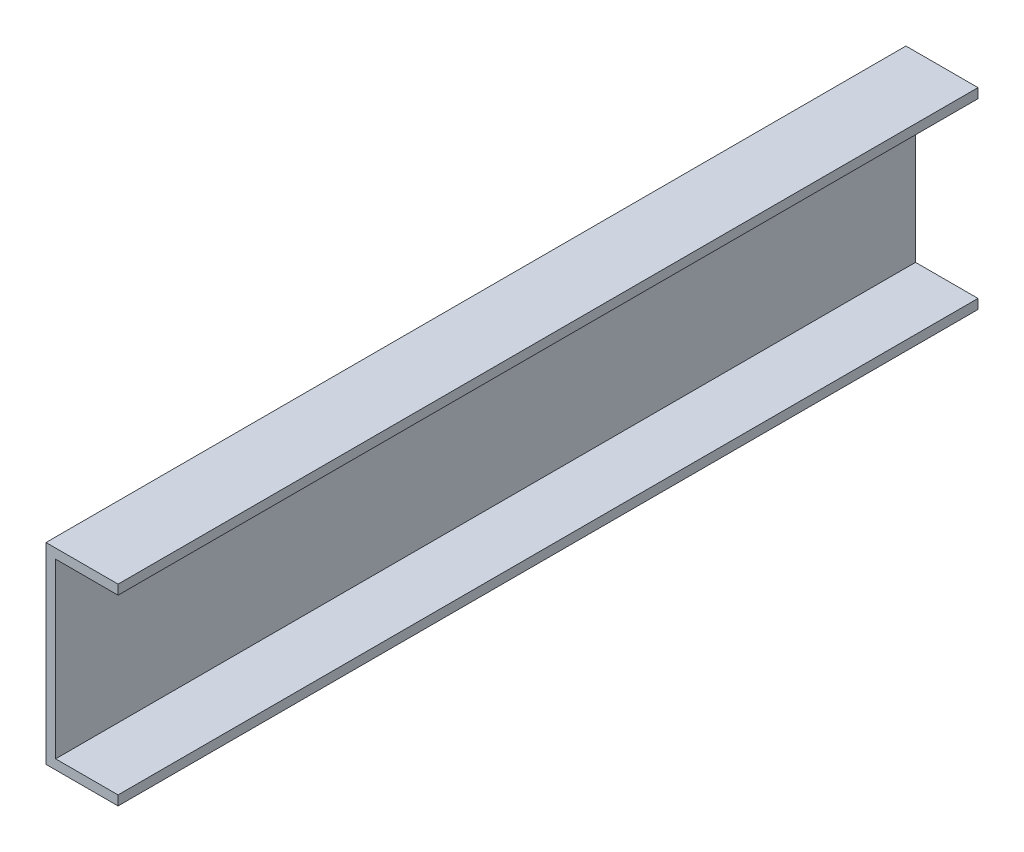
ISO-10303-21;
HEADER;
FILE_DESCRIPTION(('STEP AP214'),'2;1');
FILE_NAME('part.step','',(''),(''),'','','');
FILE_SCHEMA(('AUTOMOTIVE_DESIGN { 1 0 10303 214 1 1 1 1 }'));
ENDSEC;
DATA;
#1=APPLICATION_CONTEXT('core data for automotive mechanical design processes');
#2=APPLICATION_PROTOCOL_DEFINITION('international standard','automotive_design',2000,#1);
#3=PRODUCT_CONTEXT('',#1,'mechanical');
#4=PRODUCT('Part','Part','',(#3));
#5=PRODUCT_RELATED_PRODUCT_CATEGORY('part','',(#4));
#6=PRODUCT_DEFINITION_FORMATION('','',#4);
#7=PRODUCT_DEFINITION_CONTEXT('part definition',#1,'design');
#8=PRODUCT_DEFINITION('design','',#6,#7);
#9=PRODUCT_DEFINITION_SHAPE('','',#8);
#10=(LENGTH_UNIT() NAMED_UNIT(*) SI_UNIT(.MILLI.,.METRE.));
#11=(NAMED_UNIT(*) PLANE_ANGLE_UNIT() SI_UNIT($,.RADIAN.));
#12=(NAMED_UNIT(*) SI_UNIT($,.STERADIAN.) SOLID_ANGLE_UNIT());
#13=UNCERTAINTY_MEASURE_WITH_UNIT(LENGTH_MEASURE(1.E-05),#10,'distance_accuracy_value','');
#14=(GEOMETRIC_REPRESENTATION_CONTEXT(3) GLOBAL_UNCERTAINTY_ASSIGNED_CONTEXT((#13)) GLOBAL_UNIT_ASSIGNED_CONTEXT((#10,
#11,#12)) REPRESENTATION_CONTEXT('',''));
#15=CARTESIAN_POINT('',(0.,0.,0.));
#16=DIRECTION('',(0.,0.,1.));
#17=DIRECTION('',(1.,0.,0.));
#18=AXIS2_PLACEMENT_3D('',#15,#16,#17);
#19=CARTESIAN_POINT('',(75.,10.,447.5));
#20=DIRECTION('',(-1.,0.,0.));
#21=DIRECTION('',(0.,0.,1.));
#22=AXIS2_PLACEMENT_3D('',#19,#20,#21);
#23=PLANE('',#22);
#24=DIRECTION('',(0.,1.,0.));
#25=VECTOR('',#24,1.);
#26=CARTESIAN_POINT('',(75.,10.,-447.5));
#27=LINE('',#26,#25);
#28=CARTESIAN_POINT('',(75.,0.,-447.5));
#29=VERTEX_POINT('',#28);
#30=CARTESIAN_POINT('',(75.,10.,-447.5));
#31=VERTEX_POINT('',#30);
#32=EDGE_CURVE('E129',#29,#31,#27,.T.);
#33=ORIENTED_EDGE('',*,*,#32,.T.);
#34=DIRECTION('',(0.,0.,-1.));
#35=VECTOR('',#34,1.);
#36=CARTESIAN_POINT('',(75.,10.,447.5));
#37=LINE('',#36,#35);
#38=CARTESIAN_POINT('',(75.,10.,447.5));
#39=VERTEX_POINT('',#38);
#40=EDGE_CURVE('E11',#39,#31,#37,.T.);
#41=ORIENTED_EDGE('',*,*,#40,.F.);
#42=DIRECTION('',(0.,1.,0.));
#43=VECTOR('',#42,1.);
#44=CARTESIAN_POINT('',(75.,10.,447.5));
#45=LINE('',#44,#43);
#46=CARTESIAN_POINT('',(75.,0.,447.5));
#47=VERTEX_POINT('',#46);
#48=EDGE_CURVE('E143',#47,#39,#45,.T.);
#49=ORIENTED_EDGE('',*,*,#48,.F.);
#50=DIRECTION('',(0.,0.,-1.));
#51=VECTOR('',#50,1.);
#52=CARTESIAN_POINT('',(75.,0.,447.5));
#53=LINE('',#52,#51);
#54=EDGE_CURVE('E125',#47,#29,#53,.T.);
#55=ORIENTED_EDGE('',*,*,#54,.T.);
#56=EDGE_LOOP('',(#33,#41,#49,#55));
#57=FACE_BOUND('',#56,.T.);
#58=ADVANCED_FACE('F33',(#57),#23,.F.);
#59=CARTESIAN_POINT('',(10.,10.,447.5));
#60=DIRECTION('',(0.,-1.,0.));
#61=DIRECTION('',(0.,0.,-1.));
#62=AXIS2_PLACEMENT_3D('',#59,#60,#61);
#63=PLANE('',#62);
#64=DIRECTION('',(-1.,0.,0.));
#65=VECTOR('',#64,1.);
#66=CARTESIAN_POINT('',(10.,10.,-447.5));
#67=LINE('',#66,#65);
#68=CARTESIAN_POINT('',(10.,10.,-447.5));
#69=VERTEX_POINT('',#68);
#70=EDGE_CURVE('E132',#31,#69,#67,.T.);
#71=ORIENTED_EDGE('',*,*,#70,.T.);
#72=DIRECTION('',(0.,0.,-1.));
#73=VECTOR('',#72,1.);
#74=CARTESIAN_POINT('',(10.,10.,447.5));
#75=LINE('',#74,#73);
#76=CARTESIAN_POINT('',(10.,10.,447.5));
#77=VERTEX_POINT('',#76);
#78=EDGE_CURVE('E41',#77,#69,#75,.T.);
#79=ORIENTED_EDGE('',*,*,#78,.F.);
#80=DIRECTION('',(-1.,0.,0.));
#81=VECTOR('',#80,1.);
#82=CARTESIAN_POINT('',(10.,10.,447.5));
#83=LINE('',#82,#81);
#84=EDGE_CURVE('E92',#39,#77,#83,.T.);
#85=ORIENTED_EDGE('',*,*,#84,.F.);
#86=ORIENTED_EDGE('',*,*,#40,.T.);
#87=EDGE_LOOP('',(#71,#79,#85,#86));
#88=FACE_BOUND('',#87,.T.);
#89=ADVANCED_FACE('F178',(#88),#63,.F.);
#90=CARTESIAN_POINT('',(9.99999999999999,190.,447.5));
#91=DIRECTION('',(-1.,0.,0.));
#92=DIRECTION('',(0.,-1.,0.));
#93=AXIS2_PLACEMENT_3D('',#90,#91,#92);
#94=PLANE('',#93);
#95=DIRECTION('',(0.,1.,0.));
#96=VECTOR('',#95,1.);
#97=CARTESIAN_POINT('',(9.99999999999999,190.,-447.5));
#98=LINE('',#97,#96);
#99=CARTESIAN_POINT('',(9.99999999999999,190.,-447.5));
#100=VERTEX_POINT('',#99);
#101=EDGE_CURVE('E134',#69,#100,#98,.T.);
#102=ORIENTED_EDGE('',*,*,#101,.T.);
#103=DIRECTION('',(0.,0.,-1.));
#104=VECTOR('',#103,1.);
#105=CARTESIAN_POINT('',(9.99999999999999,190.,447.5));
#106=LINE('',#105,#104);
#107=CARTESIAN_POINT('',(9.99999999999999,190.,447.5));
#108=VERTEX_POINT('',#107);
#109=EDGE_CURVE('E150',#108,#100,#106,.T.);
#110=ORIENTED_EDGE('',*,*,#109,.F.);
#111=DIRECTION('',(0.,1.,0.));
#112=VECTOR('',#111,1.);
#113=CARTESIAN_POINT('',(9.99999999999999,190.,447.5));
#114=LINE('',#113,#112);
#115=EDGE_CURVE('E158',#77,#108,#114,.T.);
#116=ORIENTED_EDGE('',*,*,#115,.F.);
#117=ORIENTED_EDGE('',*,*,#78,.T.);
#118=EDGE_LOOP('',(#102,#110,#116,#117));
#119=FACE_BOUND('',#118,.T.);
#120=ADVANCED_FACE('F156',(#119),#94,.F.);
#121=CARTESIAN_POINT('',(75.,190.,447.5));
#122=DIRECTION('',(0.,1.,0.));
#123=DIRECTION('',(0.,0.,1.));
#124=AXIS2_PLACEMENT_3D('',#121,#122,#123);
#125=PLANE('',#124);
#126=DIRECTION('',(1.,0.,0.));
#127=VECTOR('',#126,1.);
#128=CARTESIAN_POINT('',(75.,190.,-447.5));
#129=LINE('',#128,#127);
#130=CARTESIAN_POINT('',(75.,190.,-447.5));
#131=VERTEX_POINT('',#130);
#132=EDGE_CURVE('E136',#100,#131,#129,.T.);
#133=ORIENTED_EDGE('',*,*,#132,.T.);
#134=DIRECTION('',(0.,0.,-1.));
#135=VECTOR('',#134,1.);
#136=CARTESIAN_POINT('',(75.,190.,447.5));
#137=LINE('',#136,#135);
#138=CARTESIAN_POINT('',(75.,190.,447.5));
#139=VERTEX_POINT('',#138);
#140=EDGE_CURVE('E147',#139,#131,#137,.T.);
#141=ORIENTED_EDGE('',*,*,#140,.F.);
#142=DIRECTION('',(1.,0.,0.));
#143=VECTOR('',#142,1.);
#144=CARTESIAN_POINT('',(75.,190.,447.5));
#145=LINE('',#144,#143);
#146=EDGE_CURVE('E170',#108,#139,#145,.T.);
#147=ORIENTED_EDGE('',*,*,#146,.F.);
#148=ORIENTED_EDGE('',*,*,#109,.T.);
#149=EDGE_LOOP('',(#133,#141,#147,#148));
#150=FACE_BOUND('',#149,.T.);
#151=ADVANCED_FACE('F166',(#150),#125,.F.);
#152=CARTESIAN_POINT('',(75.,200.,447.5));
#153=DIRECTION('',(-1.,0.,0.));
#154=DIRECTION('',(0.,-1.,0.));
#155=AXIS2_PLACEMENT_3D('',#152,#153,#154);
#156=PLANE('',#155);
#157=DIRECTION('',(0.,1.,0.));
#158=VECTOR('',#157,1.);
#159=CARTESIAN_POINT('',(75.,200.,-447.5));
#160=LINE('',#159,#158);
#161=CARTESIAN_POINT('',(75.,200.,-447.5));
#162=VERTEX_POINT('',#161);
#163=EDGE_CURVE('E138',#131,#162,#160,.T.);
#164=ORIENTED_EDGE('',*,*,#163,.T.);
#165=DIRECTION('',(0.,0.,-1.));
#166=VECTOR('',#165,1.);
#167=CARTESIAN_POINT('',(75.,200.,447.5));
#168=LINE('',#167,#166);
#169=CARTESIAN_POINT('',(75.,200.,447.5));
#170=VERTEX_POINT('',#169);
#171=EDGE_CURVE('E120',#170,#162,#168,.T.);
#172=ORIENTED_EDGE('',*,*,#171,.F.);
#173=DIRECTION('',(0.,1.,0.));
#174=VECTOR('',#173,1.);
#175=CARTESIAN_POINT('',(75.,200.,447.5));
#176=LINE('',#175,#174);
#177=EDGE_CURVE('E111',#139,#170,#176,.T.);
#178=ORIENTED_EDGE('',*,*,#177,.F.);
#179=ORIENTED_EDGE('',*,*,#140,.T.);
#180=EDGE_LOOP('',(#164,#172,#178,#179));
#181=FACE_BOUND('',#180,.T.);
#182=ADVANCED_FACE('F169',(#181),#156,.F.);
#183=CARTESIAN_POINT('',(0.,200.,447.5));
#184=DIRECTION('',(0.,-1.,0.));
#185=DIRECTION('',(0.,0.,-1.));
#186=AXIS2_PLACEMENT_3D('',#183,#184,#185);
#187=PLANE('',#186);
#188=DIRECTION('',(-1.,0.,0.));
#189=VECTOR('',#188,1.);
#190=CARTESIAN_POINT('',(0.,200.,-447.5));
#191=LINE('',#190,#189);
#192=CARTESIAN_POINT('',(0.,200.,-447.5));
#193=VERTEX_POINT('',#192);
#194=EDGE_CURVE('E119',#162,#193,#191,.T.);
#195=ORIENTED_EDGE('',*,*,#194,.T.);
#196=DIRECTION('',(0.,0.,-1.));
#197=VECTOR('',#196,1.);
#198=CARTESIAN_POINT('',(0.,200.,447.5));
#199=LINE('',#198,#197);
#200=CARTESIAN_POINT('',(0.,200.,447.5));
#201=VERTEX_POINT('',#200);
#202=EDGE_CURVE('E116',#201,#193,#199,.T.);
#203=ORIENTED_EDGE('',*,*,#202,.F.);
#204=DIRECTION('',(-1.,0.,0.));
#205=VECTOR('',#204,1.);
#206=CARTESIAN_POINT('',(0.,200.,447.5));
#207=LINE('',#206,#205);
#208=EDGE_CURVE('E105',#170,#201,#207,.T.);
#209=ORIENTED_EDGE('',*,*,#208,.F.);
#210=ORIENTED_EDGE('',*,*,#171,.T.);
#211=EDGE_LOOP('',(#195,#203,#209,#210));
#212=FACE_BOUND('',#211,.T.);
#213=ADVANCED_FACE('F117',(#212),#187,.F.);
#214=CARTESIAN_POINT('',(0.,0.,447.5));
#215=DIRECTION('',(1.,0.,0.));
#216=DIRECTION('',(0.,0.,-1.));
#217=AXIS2_PLACEMENT_3D('',#214,#215,#216);
#218=PLANE('',#217);
#219=DIRECTION('',(0.,-1.,0.));
#220=VECTOR('',#219,1.);
#221=CARTESIAN_POINT('',(0.,0.,-447.5));
#222=LINE('',#221,#220);
#223=CARTESIAN_POINT('',(0.,0.,-447.5));
#224=VERTEX_POINT('',#223);
#225=EDGE_CURVE('E78',#193,#224,#222,.T.);
#226=ORIENTED_EDGE('',*,*,#225,.T.);
#227=DIRECTION('',(0.,0.,-1.));
#228=VECTOR('',#227,1.);
#229=CARTESIAN_POINT('',(0.,0.,447.5));
#230=LINE('',#229,#228);
#231=CARTESIAN_POINT('',(0.,0.,447.5));
#232=VERTEX_POINT('',#231);
#233=EDGE_CURVE('E121',#232,#224,#230,.T.);
#234=ORIENTED_EDGE('',*,*,#233,.F.);
#235=DIRECTION('',(0.,-1.,0.));
#236=VECTOR('',#235,1.);
#237=CARTESIAN_POINT('',(0.,0.,447.5));
#238=LINE('',#237,#236);
#239=EDGE_CURVE('E109',#201,#232,#238,.T.);
#240=ORIENTED_EDGE('',*,*,#239,.F.);
#241=ORIENTED_EDGE('',*,*,#202,.T.);
#242=EDGE_LOOP('',(#226,#234,#240,#241));
#243=FACE_BOUND('',#242,.T.);
#244=ADVANCED_FACE('F123',(#243),#218,.F.);
#245=CARTESIAN_POINT('',(75.,0.,447.5));
#246=DIRECTION('',(0.,1.,0.));
#247=DIRECTION('',(-1.,0.,0.));
#248=AXIS2_PLACEMENT_3D('',#245,#246,#247);
#249=PLANE('',#248);
#250=DIRECTION('',(1.,0.,0.));
#251=VECTOR('',#250,1.);
#252=CARTESIAN_POINT('',(75.,0.,-447.5));
#253=LINE('',#252,#251);
#254=EDGE_CURVE('E84',#224,#29,#253,.T.);
#255=ORIENTED_EDGE('',*,*,#254,.T.);
#256=ORIENTED_EDGE('',*,*,#54,.F.);
#257=DIRECTION('',(1.,0.,0.));
#258=VECTOR('',#257,1.);
#259=CARTESIAN_POINT('',(75.,0.,447.5));
#260=LINE('',#259,#258);
#261=EDGE_CURVE('E49',#232,#47,#260,.T.);
#262=ORIENTED_EDGE('',*,*,#261,.F.);
#263=ORIENTED_EDGE('',*,*,#233,.T.);
#264=EDGE_LOOP('',(#255,#256,#262,#263));
#265=FACE_BOUND('',#264,.T.);
#266=ADVANCED_FACE('F194',(#265),#249,.F.);
#267=CARTESIAN_POINT('',(0.,0.,447.5));
#268=DIRECTION('',(0.,0.,-1.));
#269=DIRECTION('',(-1.,0.,0.));
#270=AXIS2_PLACEMENT_3D('',#267,#268,#269);
#271=PLANE('',#270);
#272=ORIENTED_EDGE('',*,*,#48,.T.);
#273=ORIENTED_EDGE('',*,*,#84,.T.);
#274=ORIENTED_EDGE('',*,*,#115,.T.);
#275=ORIENTED_EDGE('',*,*,#146,.T.);
#276=ORIENTED_EDGE('',*,*,#177,.T.);
#277=ORIENTED_EDGE('',*,*,#208,.T.);
#278=ORIENTED_EDGE('',*,*,#239,.T.);
#279=ORIENTED_EDGE('',*,*,#261,.T.);
#280=EDGE_LOOP('',(#272,#273,#274,#275,#276,#277,#278,#279));
#281=FACE_BOUND('',#280,.T.);
#282=ADVANCED_FACE('F107',(#281),#271,.F.);
#283=CARTESIAN_POINT('',(0.,0.,-447.5));
#284=DIRECTION('',(0.,0.,-1.));
#285=DIRECTION('',(-1.,0.,0.));
#286=AXIS2_PLACEMENT_3D('',#283,#284,#285);
#287=PLANE('',#286);
#288=ORIENTED_EDGE('',*,*,#32,.F.);
#289=ORIENTED_EDGE('',*,*,#254,.F.);
#290=ORIENTED_EDGE('',*,*,#225,.F.);
#291=ORIENTED_EDGE('',*,*,#194,.F.);
#292=ORIENTED_EDGE('',*,*,#163,.F.);
#293=ORIENTED_EDGE('',*,*,#132,.F.);
#294=ORIENTED_EDGE('',*,*,#101,.F.);
#295=ORIENTED_EDGE('',*,*,#70,.F.);
#296=EDGE_LOOP('',(#288,#289,#290,#291,#292,#293,#294,#295));
#297=FACE_BOUND('',#296,.T.);
#298=ADVANCED_FACE('F162',(#297),#287,.T.);
#299=CLOSED_SHELL('',(#58,#89,#120,#151,#182,#213,#244,#266,#282,#298));
#300=MANIFOLD_SOLID_BREP('B2',#299);
#301=ADVANCED_BREP_SHAPE_REPRESENTATION('',(#18,#300),#14);
#302=SHAPE_DEFINITION_REPRESENTATION(#9,#301);
ENDSEC;
END-ISO-10303-21;
